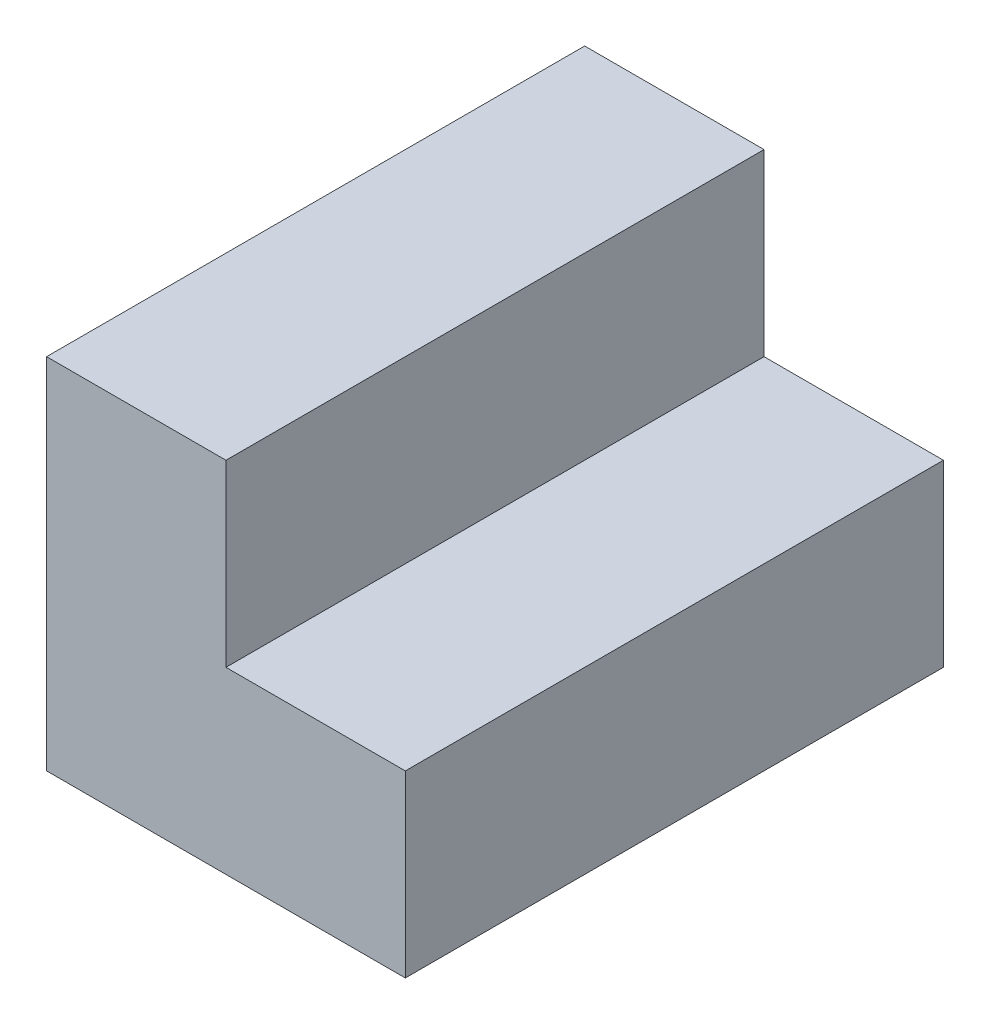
from build123d import *

# Parameters (mm, degrees)
SKETCH1_W      = 50.8
SKETCH1_H      = 50.8
EXTRUDE1_DEPTH = 152.4


with BuildPart() as part:
    # Sketch1 → Extrude1 (new body)
    with BuildSketch(Plane.XY):
        with Locations((25.4, 25.4)):
            Rectangle(SKETCH1_W, SKETCH1_H)
        Polygon((-50.8, 0), (0, 0), (0, 50.8), (0, 101.6), (-50.8, 101.6), align=None)
    extrude(amount=EXTRUDE1_DEPTH)


solid = part.part
